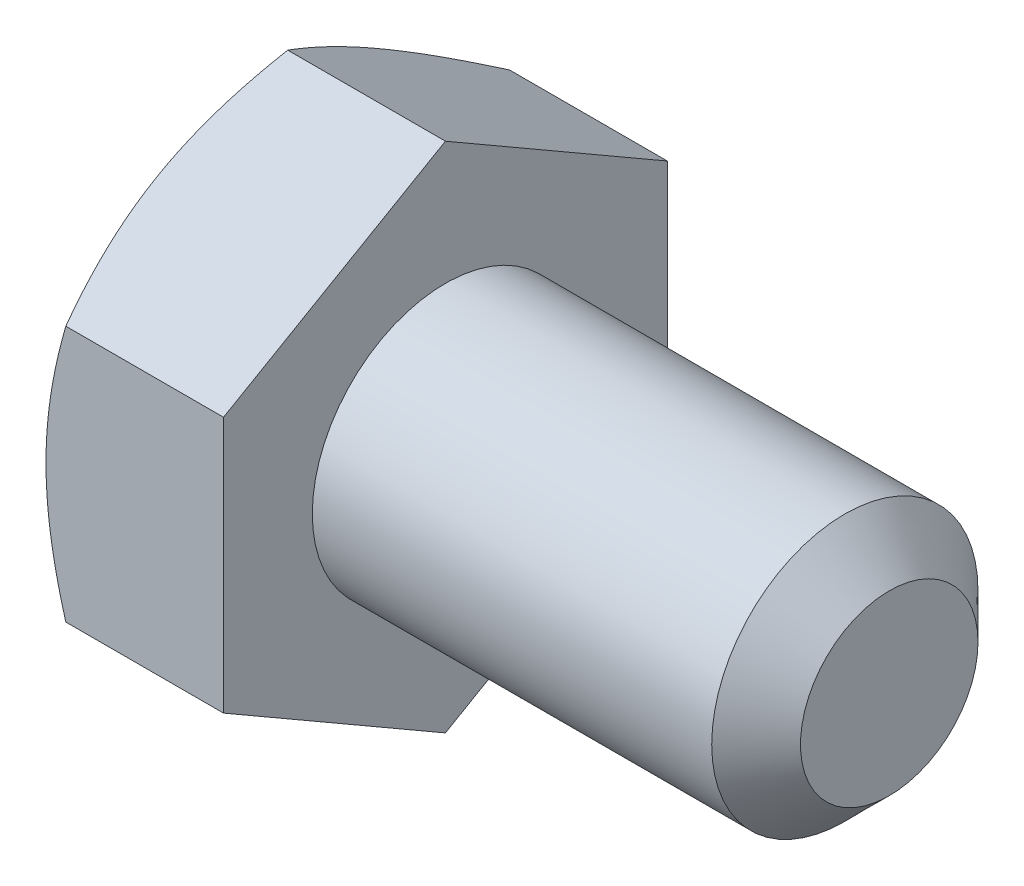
ISO-10303-21;
HEADER;
FILE_DESCRIPTION(('STEP AP214'),'2;1');
FILE_NAME('part.step','',(''),(''),'','','');
FILE_SCHEMA(('AUTOMOTIVE_DESIGN { 1 0 10303 214 1 1 1 1 }'));
ENDSEC;
DATA;
#1=APPLICATION_CONTEXT('core data for automotive mechanical design processes');
#2=APPLICATION_PROTOCOL_DEFINITION('international standard','automotive_design',2000,#1);
#3=PRODUCT_CONTEXT('',#1,'mechanical');
#4=PRODUCT('Part','Part','',(#3));
#5=PRODUCT_RELATED_PRODUCT_CATEGORY('part','',(#4));
#6=PRODUCT_DEFINITION_FORMATION('','',#4);
#7=PRODUCT_DEFINITION_CONTEXT('part definition',#1,'design');
#8=PRODUCT_DEFINITION('design','',#6,#7);
#9=PRODUCT_DEFINITION_SHAPE('','',#8);
#10=(LENGTH_UNIT() NAMED_UNIT(*) SI_UNIT(.MILLI.,.METRE.));
#11=(NAMED_UNIT(*) PLANE_ANGLE_UNIT() SI_UNIT($,.RADIAN.));
#12=(NAMED_UNIT(*) SI_UNIT($,.STERADIAN.) SOLID_ANGLE_UNIT());
#13=UNCERTAINTY_MEASURE_WITH_UNIT(LENGTH_MEASURE(1.E-05),#10,'distance_accuracy_value','');
#14=(GEOMETRIC_REPRESENTATION_CONTEXT(3) GLOBAL_UNCERTAINTY_ASSIGNED_CONTEXT((#13)) GLOBAL_UNIT_ASSIGNED_CONTEXT((#10,
#11,#12)) REPRESENTATION_CONTEXT('',''));
#15=CARTESIAN_POINT('',(0.,0.,0.));
#16=DIRECTION('',(0.,0.,1.));
#17=DIRECTION('',(1.,0.,0.));
#18=AXIS2_PLACEMENT_3D('',#15,#16,#17);
#19=CARTESIAN_POINT('',(10.0000000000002,0.,0.));
#20=DIRECTION('',(-1.,0.,0.));
#21=DIRECTION('',(0.,0.,1.));
#22=AXIS2_PLACEMENT_3D('',#19,#20,#21);
#23=CYLINDRICAL_SURFACE('',#22,3.);
#24=CARTESIAN_POINT('',(9.0000000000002,0.,0.));
#25=DIRECTION('',(1.,0.,0.));
#26=DIRECTION('',(0.,0.,-1.));
#27=AXIS2_PLACEMENT_3D('',#24,#25,#26);
#28=CIRCLE('',#27,3.);
#29=CARTESIAN_POINT('',(9.0000000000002,0.,-3.));
#30=VERTEX_POINT('',#29);
#31=EDGE_CURVE('E11',#30,#30,#28,.F.);
#32=ORIENTED_EDGE('',*,*,#31,.T.);
#33=EDGE_LOOP('',(#32));
#34=FACE_BOUND('',#33,.T.);
#35=CARTESIAN_POINT('',(0.,0.,0.));
#36=DIRECTION('',(-1.,0.,0.));
#37=DIRECTION('',(0.,0.,1.));
#38=AXIS2_PLACEMENT_3D('',#35,#36,#37);
#39=CIRCLE('',#38,3.);
#40=CARTESIAN_POINT('',(0.,0.,3.));
#41=VERTEX_POINT('',#40);
#42=EDGE_CURVE('E206',#41,#41,#39,.T.);
#43=ORIENTED_EDGE('',*,*,#42,.F.);
#44=EDGE_LOOP('',(#43));
#45=FACE_BOUND('',#44,.T.);
#46=ADVANCED_FACE('F32',(#34,#45),#23,.T.);
#47=CARTESIAN_POINT('',(10.0000000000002,0.,0.));
#48=DIRECTION('',(1.,0.,0.));
#49=DIRECTION('',(0.,0.,-1.));
#50=AXIS2_PLACEMENT_3D('',#47,#48,#49);
#51=PLANE('',#50);
#52=CARTESIAN_POINT('',(10.0000000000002,0.,0.));
#53=DIRECTION('',(1.,0.,0.));
#54=DIRECTION('',(0.,0.,-1.));
#55=AXIS2_PLACEMENT_3D('',#52,#53,#54);
#56=CIRCLE('',#55,1.99999999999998);
#57=CARTESIAN_POINT('',(10.0000000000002,0.,-1.99999999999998));
#58=VERTEX_POINT('',#57);
#59=EDGE_CURVE('E39',#58,#58,#56,.T.);
#60=ORIENTED_EDGE('',*,*,#59,.T.);
#61=EDGE_LOOP('',(#60));
#62=FACE_BOUND('',#61,.T.);
#63=ADVANCED_FACE('F192',(#62),#51,.T.);
#64=CARTESIAN_POINT('',(0.,-2.88675134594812,5.00000000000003));
#65=DIRECTION('',(-1.,0.,0.));
#66=DIRECTION('',(0.,0.,1.));
#67=AXIS2_PLACEMENT_3D('',#64,#65,#66);
#68=PLANE('',#67);
#69=DIRECTION('',(0.,0.500000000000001,0.866025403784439));
#70=VECTOR('',#69,1.);
#71=CARTESIAN_POINT('',(0.,-5.77350269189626,0.));
#72=LINE('',#71,#70);
#73=CARTESIAN_POINT('',(0.,-5.77350269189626,0.));
#74=VERTEX_POINT('',#73);
#75=CARTESIAN_POINT('',(0.,-2.88675134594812,5.00000000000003));
#76=VERTEX_POINT('',#75);
#77=EDGE_CURVE('E233',#74,#76,#72,.T.);
#78=ORIENTED_EDGE('',*,*,#77,.F.);
#79=DIRECTION('',(0.,0.500000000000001,-0.866025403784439));
#80=VECTOR('',#79,1.);
#81=CARTESIAN_POINT('',(0.,-5.77350269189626,0.));
#82=LINE('',#81,#80);
#83=CARTESIAN_POINT('',(0.,-2.88675134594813,-5.));
#84=VERTEX_POINT('',#83);
#85=EDGE_CURVE('E220',#74,#84,#82,.T.);
#86=ORIENTED_EDGE('',*,*,#85,.T.);
#87=DIRECTION('',(0.,1.,0.));
#88=VECTOR('',#87,1.);
#89=CARTESIAN_POINT('',(0.,-2.88675134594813,-5.));
#90=LINE('',#89,#88);
#91=CARTESIAN_POINT('',(0.,2.88675134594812,-5.));
#92=VERTEX_POINT('',#91);
#93=EDGE_CURVE('E223',#84,#92,#90,.T.);
#94=ORIENTED_EDGE('',*,*,#93,.T.);
#95=DIRECTION('',(0.,0.500000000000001,0.866025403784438));
#96=VECTOR('',#95,1.);
#97=CARTESIAN_POINT('',(0.,2.88675134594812,-5.));
#98=LINE('',#97,#96);
#99=CARTESIAN_POINT('',(0.,5.77350269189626,0.));
#100=VERTEX_POINT('',#99);
#101=EDGE_CURVE('E226',#92,#100,#98,.T.);
#102=ORIENTED_EDGE('',*,*,#101,.T.);
#103=DIRECTION('',(0.,0.500000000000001,-0.866025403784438));
#104=VECTOR('',#103,1.);
#105=CARTESIAN_POINT('',(0.,2.88675134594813,5.));
#106=LINE('',#105,#104);
#107=CARTESIAN_POINT('',(0.,2.88675134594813,5.));
#108=VERTEX_POINT('',#107);
#109=EDGE_CURVE('E229',#108,#100,#106,.T.);
#110=ORIENTED_EDGE('',*,*,#109,.F.);
#111=DIRECTION('',(0.,1.,0.));
#112=VECTOR('',#111,1.);
#113=CARTESIAN_POINT('',(0.,-2.88675134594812,5.00000000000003));
#114=LINE('',#113,#112);
#115=EDGE_CURVE('E231',#76,#108,#114,.T.);
#116=ORIENTED_EDGE('',*,*,#115,.F.);
#117=EDGE_LOOP('',(#78,#86,#94,#102,#110,#116));
#118=FACE_BOUND('',#117,.T.);
#119=ORIENTED_EDGE('',*,*,#42,.T.);
#120=EDGE_LOOP('',(#119));
#121=FACE_BOUND('',#120,.T.);
#122=ADVANCED_FACE('F163',(#118,#121),#68,.F.);
#123=CARTESIAN_POINT('',(-4.,-5.77350269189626,0.));
#124=DIRECTION('',(0.,0.866025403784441,-0.5));
#125=DIRECTION('',(0.,0.500000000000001,0.866025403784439));
#126=AXIS2_PLACEMENT_3D('',#123,#124,#125);
#127=PLANE('',#126);
#128=CARTESIAN_POINT('',(-3.55335134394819,-5.77361816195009,-0.000199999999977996));
#129=CARTESIAN_POINT('',(-3.62661343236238,-5.6467543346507,0.219534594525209));
#130=CARTESIAN_POINT('',(-3.69324867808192,-5.51880543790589,0.441148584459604));
#131=CARTESIAN_POINT('',(-3.8095610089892,-5.26069210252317,0.888213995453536));
#132=CARTESIAN_POINT('',(-3.85919695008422,-5.1305230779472,1.1136733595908));
#133=CARTESIAN_POINT('',(-3.93644897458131,-4.87177839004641,1.56183230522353));
#134=CARTESIAN_POINT('',(-3.96457962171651,-4.74324302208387,1.78446209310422));
#135=CARTESIAN_POINT('',(-3.98980507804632,-4.54998783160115,2.11918990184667));
#136=CARTESIAN_POINT('',(-3.99538654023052,-4.48552534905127,2.23084219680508));
#137=CARTESIAN_POINT('',(-4.00079778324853,-4.35654081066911,2.45424997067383));
#138=CARTESIAN_POINT('',(-4.0006277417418,-4.29201875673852,2.56600544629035));
#139=CARTESIAN_POINT('',(-3.99224636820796,-4.11524635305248,2.87218423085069));
#140=CARTESIAN_POINT('',(-3.97817022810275,-4.00305457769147,3.06650608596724));
#141=CARTESIAN_POINT('',(-3.93353474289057,-3.77941563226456,3.45386010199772));
#142=CARTESIAN_POINT('',(-3.90296013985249,-3.66796924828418,3.64689090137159));
#143=CARTESIAN_POINT('',(-3.82653150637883,-3.44387972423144,4.03502534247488));
#144=CARTESIAN_POINT('',(-3.78035362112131,-3.33126486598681,4.23007999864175));
#145=CARTESIAN_POINT('',(-3.67554820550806,-3.10771464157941,4.61728034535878));
#146=CARTESIAN_POINT('',(-3.61694529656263,-2.99677641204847,4.8094309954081));
#147=CARTESIAN_POINT('',(-3.55335134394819,-2.88663587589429,5.00020000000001));
#148=B_SPLINE_CURVE_WITH_KNOTS('',3,(#128,#129,#130,#131,#132,#133,#134,#135,#136,#137,#138,
#139,#140,#141,#142,#143,#144,#145,#146,#147),.UNSPECIFIED.,.F.,.F.,(4,2,2,2,2,2,2,2,2,4),(0.,
0.792555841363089,1.58701660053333,2.3618153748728,2.74884076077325,3.13585419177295,
3.80962362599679,4.48401723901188,5.17336882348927,5.86136694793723),.UNSPECIFIED.);
#149=CARTESIAN_POINT('',(-3.55341801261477,-5.77350269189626,0.));
#150=VERTEX_POINT('',#149);
#151=CARTESIAN_POINT('',(-4.,-4.33012701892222,2.5));
#152=VERTEX_POINT('',#151);
#153=EDGE_CURVE('E180',#150,#152,#148,.T.);
#154=ORIENTED_EDGE('',*,*,#153,.F.);
#155=DIRECTION('',(1.,0.,0.));
#156=VECTOR('',#155,1.);
#157=CARTESIAN_POINT('',(-4.,-5.77350269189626,0.));
#158=LINE('',#157,#156);
#159=EDGE_CURVE('E218',#150,#74,#158,.T.);
#160=ORIENTED_EDGE('',*,*,#159,.T.);
#161=ORIENTED_EDGE('',*,*,#77,.T.);
#162=DIRECTION('',(1.,0.,0.));
#163=VECTOR('',#162,1.);
#164=CARTESIAN_POINT('',(-4.,-2.88675134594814,5.));
#165=LINE('',#164,#163);
#166=CARTESIAN_POINT('',(-3.55341801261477,-2.88675134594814,5.));
#167=VERTEX_POINT('',#166);
#168=EDGE_CURVE('E209',#167,#76,#165,.T.);
#169=ORIENTED_EDGE('',*,*,#168,.F.);
#170=EDGE_CURVE('E134',#152,#167,#148,.T.);
#171=ORIENTED_EDGE('',*,*,#170,.F.);
#172=EDGE_LOOP('',(#154,#160,#161,#169,#171));
#173=FACE_BOUND('',#172,.T.);
#174=ADVANCED_FACE('F186',(#173),#127,.F.);
#175=CARTESIAN_POINT('',(-4.,-2.88675134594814,5.));
#176=DIRECTION('',(0.,0.,-1.));
#177=DIRECTION('',(-1.,0.,0.));
#178=AXIS2_PLACEMENT_3D('',#175,#176,#177);
#179=PLANE('',#178);
#180=CARTESIAN_POINT('',(-1.50175754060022,-7.87365701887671,5.));
#181=CARTESIAN_POINT('',(-1.6086809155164,-7.65421637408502,5.));
#182=CARTESIAN_POINT('',(-1.71461296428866,-7.43428458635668,5.));
#183=CARTESIAN_POINT('',(-1.92393906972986,-6.99317792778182,5.));
#184=CARTESIAN_POINT('',(-2.02733274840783,-6.77200287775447,5.));
#185=CARTESIAN_POINT('',(-2.23152152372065,-6.32706593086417,5.));
#186=CARTESIAN_POINT('',(-2.33230041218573,-6.10329657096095,5.));
#187=CARTESIAN_POINT('',(-2.52988978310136,-5.65401907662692,5.));
#188=CARTESIAN_POINT('',(-2.62670044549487,-5.42851102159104,5.));
#189=CARTESIAN_POINT('',(-2.81850105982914,-4.96773019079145,5.));
#190=CARTESIAN_POINT('',(-2.91331851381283,-4.7323852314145,5.));
#191=CARTESIAN_POINT('',(-3.09606229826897,-4.25898650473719,5.));
#192=CARTESIAN_POINT('',(-3.1839878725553,-4.02093244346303,5.));
#193=CARTESIAN_POINT('',(-3.35072723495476,-3.54214478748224,5.));
#194=CARTESIAN_POINT('',(-3.42955846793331,-3.30141732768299,5.));
#195=CARTESIAN_POINT('',(-3.57565910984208,-2.81651125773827,5.));
#196=CARTESIAN_POINT('',(-3.64293203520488,-2.57233372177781,5.));
#197=CARTESIAN_POINT('',(-3.76241038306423,-2.08173956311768,5.));
#198=CARTESIAN_POINT('',(-3.81470009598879,-1.83534384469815,5.));
#199=CARTESIAN_POINT('',(-3.90133365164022,-1.33936717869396,5.00000000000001));
#200=CARTESIAN_POINT('',(-3.93567944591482,-1.08978658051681,5.00000000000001));
#201=CARTESIAN_POINT('',(-3.98324171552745,-0.591994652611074,5.));
#202=CARTESIAN_POINT('',(-3.99673913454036,-0.34381084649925,5.));
#203=CARTESIAN_POINT('',(-4.00220795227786,0.152820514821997,5.00000000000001));
#204=CARTESIAN_POINT('',(-3.99417903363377,0.401268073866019,5.00000000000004));
#205=CARTESIAN_POINT('',(-3.96311999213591,0.819539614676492,5.00000000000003));
#206=CARTESIAN_POINT('',(-3.94552930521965,0.989794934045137,5.00000000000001));
#207=CARTESIAN_POINT('',(-3.90127081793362,1.32912938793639,5.));
#208=CARTESIAN_POINT('',(-3.87460188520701,1.49820837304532,5.));
#209=CARTESIAN_POINT('',(-3.78237229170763,2.0034117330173,5.00000000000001));
#210=CARTESIAN_POINT('',(-3.70460290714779,2.33733597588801,5.00000000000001));
#211=CARTESIAN_POINT('',(-3.56883106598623,2.83691487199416,5.00000000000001));
#212=CARTESIAN_POINT('',(-3.51971360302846,3.00513229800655,5.00000000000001));
#213=CARTESIAN_POINT('',(-3.41615110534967,3.33993504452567,5.00000000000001));
#214=CARTESIAN_POINT('',(-3.36170602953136,3.50652035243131,5.00000000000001));
#215=CARTESIAN_POINT('',(-3.24838071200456,3.83810926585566,5.00000000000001));
#216=CARTESIAN_POINT('',(-3.18950171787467,4.00311330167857,5.));
#217=CARTESIAN_POINT('',(-3.06802383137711,4.33173746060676,5.00000000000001));
#218=CARTESIAN_POINT('',(-3.00542502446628,4.49535761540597,5.00000000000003));
#219=CARTESIAN_POINT('',(-2.83201950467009,4.93598294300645,5.00000000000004));
#220=CARTESIAN_POINT('',(-2.71826266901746,5.21182602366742,5.00000000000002));
#221=CARTESIAN_POINT('',(-2.48405585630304,5.76066658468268,5.));
#222=CARTESIAN_POINT('',(-2.36360513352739,6.03366374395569,5.00000000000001));
#223=CARTESIAN_POINT('',(-2.11759609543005,6.57746623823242,5.00000000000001));
#224=CARTESIAN_POINT('',(-1.99203582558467,6.84827068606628,5.00000000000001));
#225=CARTESIAN_POINT('',(-1.73703058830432,7.38802449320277,5.00000000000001));
#226=CARTESIAN_POINT('',(-1.60758577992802,7.65697392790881,5.00000000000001));
#227=CARTESIAN_POINT('',(-1.34544789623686,8.19381940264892,5.00000000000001));
#228=CARTESIAN_POINT('',(-1.21274991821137,8.46171304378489,5.00000000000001));
#229=CARTESIAN_POINT('',(-0.944933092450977,8.99628800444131,5.00000000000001));
#230=CARTESIAN_POINT('',(-0.8098142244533,9.26296931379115,5.00000000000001));
#231=CARTESIAN_POINT('',(-0.401627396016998,10.0614145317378,5.00000000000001));
#232=CARTESIAN_POINT('',(-0.125669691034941,10.5917004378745,5.00000000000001));
#233=CARTESIAN_POINT('',(0.4018693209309,11.5934978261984,5.00000000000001));
#234=CARTESIAN_POINT('',(0.652934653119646,12.0652823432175,5.00000000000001));
#235=CARTESIAN_POINT('',(1.1580917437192,13.0072652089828,5.00000000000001));
#236=CARTESIAN_POINT('',(1.41218368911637,13.4774634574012,5.00000000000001));
#237=CARTESIAN_POINT('',(1.92174727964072,14.4150598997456,5.00000000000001));
#238=CARTESIAN_POINT('',(2.17721139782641,14.8824621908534,5.00000000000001));
#239=CARTESIAN_POINT('',(2.68985606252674,15.8162766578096,5.00000000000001));
#240=CARTESIAN_POINT('',(2.94703647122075,16.2826889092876,5.00000000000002));
#241=CARTESIAN_POINT('',(3.20484156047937,16.7487534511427,5.00000000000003));
#242=B_SPLINE_CURVE_WITH_KNOTS('',3,(#180,#181,#182,#183,#184,#185,#186,#187,#188,#189,#190,
#191,#192,#193,#194,#195,#196,#197,#198,#199,#200,#201,#202,#203,#204,#205,#206,#207,#208,#209,
#210,#211,#212,#213,#214,#215,#216,#217,#218,#219,#220,#221,#222,#223,#224,#225,#226,#227,#228,
#229,#230,#231,#232,#233,#234,#235,#236,#237,#238,#239,#240,#241),.UNSPECIFIED.,.F.,.F.,(4,2,2,
2,2,2,2,2,2,2,2,2,2,2,2,2,2,2,2,2,2,2,2,2,2,2,2,2,2,2,4),(0.,0.732320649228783,1.46474969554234,
2.20096737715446,2.93715163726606,3.69825037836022,4.45943251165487,5.2191293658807,
5.97859468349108,6.73369963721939,7.48872245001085,8.23347928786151,8.9782471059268,
9.49148539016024,10.0047877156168,11.0318914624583,11.5575684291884,12.0832494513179,
12.6087831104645,13.1343047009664,14.0293094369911,14.9244140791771,15.8198643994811,
16.7152781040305,17.6121361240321,18.5090016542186,20.3023290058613,21.9056050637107,
23.5089806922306,25.1069572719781,26.7048070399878),.UNSPECIFIED.);
#243=CARTESIAN_POINT('',(-4.,0.,5.));
#244=VERTEX_POINT('',#243);
#245=EDGE_CURVE('E235',#167,#244,#242,.T.);
#246=ORIENTED_EDGE('',*,*,#245,.F.);
#247=ORIENTED_EDGE('',*,*,#168,.T.);
#248=ORIENTED_EDGE('',*,*,#115,.T.);
#249=DIRECTION('',(1.,0.,0.));
#250=VECTOR('',#249,1.);
#251=CARTESIAN_POINT('',(-4.,2.88675134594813,5.));
#252=LINE('',#251,#250);
#253=CARTESIAN_POINT('',(-3.55341801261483,2.88675134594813,5.));
#254=VERTEX_POINT('',#253);
#255=EDGE_CURVE('E211',#254,#108,#252,.T.);
#256=ORIENTED_EDGE('',*,*,#255,.F.);
#257=EDGE_CURVE('E105',#244,#254,#242,.T.);
#258=ORIENTED_EDGE('',*,*,#257,.F.);
#259=EDGE_LOOP('',(#246,#247,#248,#256,#258));
#260=FACE_BOUND('',#259,.T.);
#261=ADVANCED_FACE('F189',(#260),#179,.F.);
#262=CARTESIAN_POINT('',(-4.,2.88675134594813,5.));
#263=DIRECTION('',(0.,-0.86602540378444,-0.5));
#264=DIRECTION('',(0.,0.500000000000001,-0.866025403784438));
#265=AXIS2_PLACEMENT_3D('',#262,#263,#264);
#266=PLANE('',#265);
#267=CARTESIAN_POINT('',(-3.55335134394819,2.88663587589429,5.00020000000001));
#268=CARTESIAN_POINT('',(-3.62661343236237,3.01349970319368,4.78046540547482));
#269=CARTESIAN_POINT('',(-3.69324867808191,3.14144859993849,4.55885141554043));
#270=CARTESIAN_POINT('',(-3.80956100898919,3.39956193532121,4.11178600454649));
#271=CARTESIAN_POINT('',(-3.85919695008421,3.52973095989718,3.88632664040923));
#272=CARTESIAN_POINT('',(-3.9364489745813,3.78847564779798,3.43816769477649));
#273=CARTESIAN_POINT('',(-3.96457962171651,3.91701101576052,3.21553790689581));
#274=CARTESIAN_POINT('',(-3.98980507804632,4.11026620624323,2.88081009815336));
#275=CARTESIAN_POINT('',(-3.99538654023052,4.17472868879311,2.76915780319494));
#276=CARTESIAN_POINT('',(-4.00079778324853,4.30371322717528,2.5457500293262));
#277=CARTESIAN_POINT('',(-4.0006277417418,4.36823528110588,2.43399455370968));
#278=CARTESIAN_POINT('',(-3.99224636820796,4.54500768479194,2.12781576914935));
#279=CARTESIAN_POINT('',(-3.97817022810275,4.65719946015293,1.93349391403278));
#280=CARTESIAN_POINT('',(-3.93353474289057,4.88083840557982,1.54613989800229));
#281=CARTESIAN_POINT('',(-3.90296013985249,4.99228478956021,1.35310909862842));
#282=CARTESIAN_POINT('',(-3.82653150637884,5.21637431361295,0.964974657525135));
#283=CARTESIAN_POINT('',(-3.78035362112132,5.32898917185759,0.769920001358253));
#284=CARTESIAN_POINT('',(-3.67554820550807,5.55253939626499,0.382719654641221));
#285=CARTESIAN_POINT('',(-3.61694529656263,5.66347762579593,0.190569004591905));
#286=CARTESIAN_POINT('',(-3.55335134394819,5.77361816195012,-0.000200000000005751));
#287=B_SPLINE_CURVE_WITH_KNOTS('',3,(#267,#268,#269,#270,#271,#272,#273,#274,#275,#276,#277,
#278,#279,#280,#281,#282,#283,#284,#285,#286),.UNSPECIFIED.,.F.,.F.,(4,2,2,2,2,2,2,2,2,4),(0.,
0.792555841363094,1.58701660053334,2.36181537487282,2.74884076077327,3.13585419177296,
3.80962362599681,4.48401723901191,5.17336882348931,5.86136694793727),.UNSPECIFIED.);
#288=CARTESIAN_POINT('',(-4.,4.3301270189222,2.50000000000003));
#289=VERTEX_POINT('',#288);
#290=EDGE_CURVE('E101',#254,#289,#287,.T.);
#291=ORIENTED_EDGE('',*,*,#290,.F.);
#292=ORIENTED_EDGE('',*,*,#255,.T.);
#293=ORIENTED_EDGE('',*,*,#109,.T.);
#294=DIRECTION('',(1.,0.,0.));
#295=VECTOR('',#294,1.);
#296=CARTESIAN_POINT('',(-4.,5.77350269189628,0.));
#297=LINE('',#296,#295);
#298=CARTESIAN_POINT('',(-3.55341801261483,5.77350269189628,0.));
#299=VERTEX_POINT('',#298);
#300=EDGE_CURVE('E133',#299,#100,#297,.T.);
#301=ORIENTED_EDGE('',*,*,#300,.F.);
#302=EDGE_CURVE('E109',#289,#299,#287,.T.);
#303=ORIENTED_EDGE('',*,*,#302,.F.);
#304=EDGE_LOOP('',(#291,#292,#293,#301,#303));
#305=FACE_BOUND('',#304,.T.);
#306=ADVANCED_FACE('F131',(#305),#266,.F.);
#307=CARTESIAN_POINT('',(-4.,2.88675134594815,-5.00000000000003));
#308=DIRECTION('',(0.,0.86602540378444,-0.5));
#309=DIRECTION('',(0.,0.500000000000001,0.866025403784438));
#310=AXIS2_PLACEMENT_3D('',#307,#308,#309);
#311=PLANE('',#310);
#312=DIRECTION('',(1.,0.,0.));
#313=VECTOR('',#312,1.);
#314=CARTESIAN_POINT('',(-4.,2.88675134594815,-5.00000000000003));
#315=LINE('',#314,#313);
#316=CARTESIAN_POINT('',(-3.55341801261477,2.88675134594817,-5.00000000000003));
#317=VERTEX_POINT('',#316);
#318=EDGE_CURVE('E214',#317,#92,#315,.T.);
#319=ORIENTED_EDGE('',*,*,#318,.F.);
#320=CARTESIAN_POINT('',(-3.55335134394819,2.88663587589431,-5.00019999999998));
#321=CARTESIAN_POINT('',(-3.62661343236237,3.01349970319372,-4.7804654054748));
#322=CARTESIAN_POINT('',(-3.6932486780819,3.14144859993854,-4.55885141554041));
#323=CARTESIAN_POINT('',(-3.80956100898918,3.39956193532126,-4.11178600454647));
#324=CARTESIAN_POINT('',(-3.8591969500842,3.52973095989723,-3.8863266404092));
#325=CARTESIAN_POINT('',(-3.93644897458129,3.78847564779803,-3.43816769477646));
#326=CARTESIAN_POINT('',(-3.9645796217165,3.91701101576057,-3.21553790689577));
#327=CARTESIAN_POINT('',(-3.9898050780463,4.11026620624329,-2.88081009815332));
#328=CARTESIAN_POINT('',(-3.9953865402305,4.17472868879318,-2.76915780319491));
#329=CARTESIAN_POINT('',(-4.00079778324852,4.30371322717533,-2.54575002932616));
#330=CARTESIAN_POINT('',(-4.00062774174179,4.36823528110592,-2.43399455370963));
#331=CARTESIAN_POINT('',(-3.99224636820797,4.54500768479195,-2.12781576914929));
#332=CARTESIAN_POINT('',(-3.97817022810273,4.65719946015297,-1.93349391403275));
#333=CARTESIAN_POINT('',(-3.93353474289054,4.88083840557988,-1.54613989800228));
#334=CARTESIAN_POINT('',(-3.90296013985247,4.99228478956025,-1.35310909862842));
#335=CARTESIAN_POINT('',(-3.82653150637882,5.21637431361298,-0.96497465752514));
#336=CARTESIAN_POINT('',(-3.7803536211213,5.32898917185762,-0.769920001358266));
#337=CARTESIAN_POINT('',(-3.67554820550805,5.55253939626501,-0.382719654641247));
#338=CARTESIAN_POINT('',(-3.61694529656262,5.66347762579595,-0.190569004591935));
#339=CARTESIAN_POINT('',(-3.55335134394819,5.77361816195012,0.000199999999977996));
#340=B_SPLINE_CURVE_WITH_KNOTS('',3,(#320,#321,#322,#323,#324,#325,#326,#327,#328,#329,#330,
#331,#332,#333,#334,#335,#336,#337,#338,#339),.UNSPECIFIED.,.F.,.F.,(4,2,2,2,2,2,2,2,2,4),(0.,
0.792555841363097,1.58701660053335,2.36181537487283,2.74884076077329,3.13585419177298,
3.80962362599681,4.48401723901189,5.17336882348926,5.86136694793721),.UNSPECIFIED.);
#341=CARTESIAN_POINT('',(-4.,4.33012701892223,-2.5));
#342=VERTEX_POINT('',#341);
#343=EDGE_CURVE('E136',#317,#342,#340,.T.);
#344=ORIENTED_EDGE('',*,*,#343,.T.);
#345=EDGE_CURVE('E116',#342,#299,#340,.T.);
#346=ORIENTED_EDGE('',*,*,#345,.T.);
#347=ORIENTED_EDGE('',*,*,#300,.T.);
#348=ORIENTED_EDGE('',*,*,#101,.F.);
#349=EDGE_LOOP('',(#319,#344,#346,#347,#348));
#350=FACE_BOUND('',#349,.T.);
#351=ADVANCED_FACE('F261',(#350),#311,.T.);
#352=CARTESIAN_POINT('',(-4.,-2.88675134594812,-5.));
#353=DIRECTION('',(0.,0.,-1.));
#354=DIRECTION('',(-1.,0.,0.));
#355=AXIS2_PLACEMENT_3D('',#352,#353,#354);
#356=PLANE('',#355);
#357=DIRECTION('',(1.,0.,0.));
#358=VECTOR('',#357,1.);
#359=CARTESIAN_POINT('',(-4.,-2.88675134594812,-5.));
#360=LINE('',#359,#358);
#361=CARTESIAN_POINT('',(-3.55341801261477,-2.88675134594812,-5.));
#362=VERTEX_POINT('',#361);
#363=EDGE_CURVE('E216',#362,#84,#360,.T.);
#364=ORIENTED_EDGE('',*,*,#363,.F.);
#365=CARTESIAN_POINT('',(-1.50175754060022,-7.87365701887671,-5.));
#366=CARTESIAN_POINT('',(-1.6086809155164,-7.65421637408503,-5.00000000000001));
#367=CARTESIAN_POINT('',(-1.71461296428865,-7.43428458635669,-5.00000000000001));
#368=CARTESIAN_POINT('',(-1.92393906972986,-6.99317792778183,-5.00000000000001));
#369=CARTESIAN_POINT('',(-2.02733274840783,-6.77200287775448,-5.00000000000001));
#370=CARTESIAN_POINT('',(-2.23152152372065,-6.32706593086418,-5.00000000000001));
#371=CARTESIAN_POINT('',(-2.33230041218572,-6.10329657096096,-5.00000000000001));
#372=CARTESIAN_POINT('',(-2.52988978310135,-5.65401907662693,-5.00000000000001));
#373=CARTESIAN_POINT('',(-2.62670044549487,-5.42851102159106,-5.00000000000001));
#374=CARTESIAN_POINT('',(-2.81850105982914,-4.96773019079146,-5.00000000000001));
#375=CARTESIAN_POINT('',(-2.91331851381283,-4.73238523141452,-5.00000000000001));
#376=CARTESIAN_POINT('',(-3.09606229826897,-4.2589865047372,-5.));
#377=CARTESIAN_POINT('',(-3.18398787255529,-4.02093244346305,-5.));
#378=CARTESIAN_POINT('',(-3.35072723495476,-3.54214478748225,-5.00000000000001));
#379=CARTESIAN_POINT('',(-3.42955846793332,-3.30141732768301,-5.00000000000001));
#380=CARTESIAN_POINT('',(-3.57565910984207,-2.81651125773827,-5.));
#381=CARTESIAN_POINT('',(-3.64293203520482,-2.5723337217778,-4.99999999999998));
#382=CARTESIAN_POINT('',(-3.76241038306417,-2.08173956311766,-4.99999999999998));
#383=CARTESIAN_POINT('',(-3.81470009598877,-1.83534384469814,-5.));
#384=CARTESIAN_POINT('',(-3.90133365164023,-1.33936717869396,-5.00000000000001));
#385=CARTESIAN_POINT('',(-3.93567944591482,-1.08978658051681,-5.00000000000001));
#386=CARTESIAN_POINT('',(-3.98324171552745,-0.591994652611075,-5.));
#387=CARTESIAN_POINT('',(-3.99673913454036,-0.343810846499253,-5.));
#388=CARTESIAN_POINT('',(-4.00220795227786,0.152820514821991,-5.));
#389=CARTESIAN_POINT('',(-3.99417903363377,0.401268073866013,-5.00000000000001));
#390=CARTESIAN_POINT('',(-3.96311999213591,0.819539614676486,-5.));
#391=CARTESIAN_POINT('',(-3.94552930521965,0.989794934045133,-5.));
#392=CARTESIAN_POINT('',(-3.90127081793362,1.32912938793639,-5.));
#393=CARTESIAN_POINT('',(-3.87460188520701,1.49820837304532,-5.));
#394=CARTESIAN_POINT('',(-3.78237229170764,2.0034117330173,-5.));
#395=CARTESIAN_POINT('',(-3.7046029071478,2.33733597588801,-5.));
#396=CARTESIAN_POINT('',(-3.56883106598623,2.83691487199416,-5.));
#397=CARTESIAN_POINT('',(-3.51971360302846,3.00513229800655,-5.));
#398=CARTESIAN_POINT('',(-3.41615110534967,3.33993504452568,-5.));
#399=CARTESIAN_POINT('',(-3.36170602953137,3.50652035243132,-5.));
#400=CARTESIAN_POINT('',(-3.24838071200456,3.83810926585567,-5.));
#401=CARTESIAN_POINT('',(-3.18950171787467,4.00311330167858,-5.00000000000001));
#402=CARTESIAN_POINT('',(-3.06802383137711,4.33173746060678,-5.));
#403=CARTESIAN_POINT('',(-3.00542502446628,4.49535761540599,-4.99999999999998));
#404=CARTESIAN_POINT('',(-2.83201950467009,4.93598294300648,-4.99999999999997));
#405=CARTESIAN_POINT('',(-2.71826266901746,5.21182602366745,-4.99999999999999));
#406=CARTESIAN_POINT('',(-2.48405585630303,5.7606665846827,-5.00000000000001));
#407=CARTESIAN_POINT('',(-2.36360513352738,6.03366374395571,-5.));
#408=CARTESIAN_POINT('',(-2.11759609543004,6.57746623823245,-5.));
#409=CARTESIAN_POINT('',(-1.99203582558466,6.8482706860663,-5.));
#410=CARTESIAN_POINT('',(-1.73703058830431,7.38802449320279,-5.));
#411=CARTESIAN_POINT('',(-1.607585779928,7.65697392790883,-5.));
#412=CARTESIAN_POINT('',(-1.34544789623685,8.19381940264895,-5.));
#413=CARTESIAN_POINT('',(-1.21274991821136,8.46171304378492,-5.));
#414=CARTESIAN_POINT('',(-0.944933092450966,8.99628800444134,-5.));
#415=CARTESIAN_POINT('',(-0.809814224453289,9.26296931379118,-5.));
#416=CARTESIAN_POINT('',(-0.401627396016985,10.0614145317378,-5.));
#417=CARTESIAN_POINT('',(-0.125669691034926,10.5917004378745,-5.));
#418=CARTESIAN_POINT('',(0.401869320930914,11.5934978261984,-5.));
#419=CARTESIAN_POINT('',(0.652934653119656,12.0652823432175,-5.));
#420=CARTESIAN_POINT('',(1.15809174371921,13.0072652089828,-5.));
#421=CARTESIAN_POINT('',(1.41218368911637,13.4774634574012,-5.));
#422=CARTESIAN_POINT('',(1.92174727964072,14.4150598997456,-5.));
#423=CARTESIAN_POINT('',(2.1772113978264,14.8824621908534,-5.));
#424=CARTESIAN_POINT('',(2.68985606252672,15.8162766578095,-4.99999999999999));
#425=CARTESIAN_POINT('',(2.94703647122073,16.2826889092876,-4.99999999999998));
#426=CARTESIAN_POINT('',(3.20484156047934,16.7487534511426,-4.99999999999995));
#427=B_SPLINE_CURVE_WITH_KNOTS('',3,(#365,#366,#367,#368,#369,#370,#371,#372,#373,#374,#375,
#376,#377,#378,#379,#380,#381,#382,#383,#384,#385,#386,#387,#388,#389,#390,#391,#392,#393,#394,
#395,#396,#397,#398,#399,#400,#401,#402,#403,#404,#405,#406,#407,#408,#409,#410,#411,#412,#413,
#414,#415,#416,#417,#418,#419,#420,#421,#422,#423,#424,#425,#426),.UNSPECIFIED.,.F.,.F.,(4,2,2,
2,2,2,2,2,2,2,2,2,2,2,2,2,2,2,2,2,2,2,2,2,2,2,2,2,2,2,4),(0.,0.732320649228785,1.46474969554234,
2.20096737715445,2.93715163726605,3.69825037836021,4.45943251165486,5.2191293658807,
5.97859468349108,6.73369963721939,7.48872245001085,8.23347928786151,8.97824710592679,
9.49148539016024,10.0047877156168,11.0318914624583,11.5575684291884,12.0832494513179,
12.6087831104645,13.1343047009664,14.0293094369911,14.9244140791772,15.8198643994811,
16.7152781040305,17.6121361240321,18.5090016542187,20.3023290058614,21.9056050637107,
23.5089806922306,25.1069572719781,26.7048070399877),.UNSPECIFIED.);
#428=CARTESIAN_POINT('',(-4.,0.,-5.));
#429=VERTEX_POINT('',#428);
#430=EDGE_CURVE('E54',#362,#429,#427,.T.);
#431=ORIENTED_EDGE('',*,*,#430,.T.);
#432=EDGE_CURVE('E185',#429,#317,#427,.T.);
#433=ORIENTED_EDGE('',*,*,#432,.T.);
#434=ORIENTED_EDGE('',*,*,#318,.T.);
#435=ORIENTED_EDGE('',*,*,#93,.F.);
#436=EDGE_LOOP('',(#364,#431,#433,#434,#435));
#437=FACE_BOUND('',#436,.T.);
#438=ADVANCED_FACE('F257',(#437),#356,.T.);
#439=CARTESIAN_POINT('',(-4.,-5.77350269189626,0.));
#440=DIRECTION('',(0.,-0.86602540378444,-0.5));
#441=DIRECTION('',(0.,0.500000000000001,-0.866025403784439));
#442=AXIS2_PLACEMENT_3D('',#439,#440,#441);
#443=PLANE('',#442);
#444=ORIENTED_EDGE('',*,*,#159,.F.);
#445=CARTESIAN_POINT('',(-3.55335134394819,-5.77361816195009,0.000200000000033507));
#446=CARTESIAN_POINT('',(-3.62661343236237,-5.64675433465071,-0.219534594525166));
#447=CARTESIAN_POINT('',(-3.69324867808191,-5.5188054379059,-0.44114858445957));
#448=CARTESIAN_POINT('',(-3.80956100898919,-5.26069210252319,-0.888213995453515));
#449=CARTESIAN_POINT('',(-3.85919695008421,-5.13052307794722,-1.11367335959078));
#450=CARTESIAN_POINT('',(-3.9364489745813,-4.87177839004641,-1.56183230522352));
#451=CARTESIAN_POINT('',(-3.96457962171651,-4.74324302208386,-1.7844620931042));
#452=CARTESIAN_POINT('',(-3.98980507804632,-4.54998783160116,-2.11918990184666));
#453=CARTESIAN_POINT('',(-3.99538654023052,-4.48552534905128,-2.23084219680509));
#454=CARTESIAN_POINT('',(-4.00079778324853,-4.3565408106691,-2.45424997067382));
#455=CARTESIAN_POINT('',(-4.0006277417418,-4.29201875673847,-2.56600544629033));
#456=CARTESIAN_POINT('',(-3.99224636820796,-4.1152463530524,-2.87218423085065));
#457=CARTESIAN_POINT('',(-3.97817022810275,-4.00305457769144,-3.06650608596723));
#458=CARTESIAN_POINT('',(-3.93353474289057,-3.77941563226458,-3.45386010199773));
#459=CARTESIAN_POINT('',(-3.90296013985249,-3.66796924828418,-3.64689090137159));
#460=CARTESIAN_POINT('',(-3.82653150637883,-3.44387972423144,-4.03502534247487));
#461=CARTESIAN_POINT('',(-3.78035362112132,-3.3312648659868,-4.23007999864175));
#462=CARTESIAN_POINT('',(-3.67554820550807,-3.10771464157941,-4.61728034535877));
#463=CARTESIAN_POINT('',(-3.61694529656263,-2.99677641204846,-4.80943099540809));
#464=CARTESIAN_POINT('',(-3.55335134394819,-2.88663587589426,-5.00019999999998));
#465=B_SPLINE_CURVE_WITH_KNOTS('',3,(#445,#446,#447,#448,#449,#450,#451,#452,#453,#454,#455,
#456,#457,#458,#459,#460,#461,#462,#463,#464),.UNSPECIFIED.,.F.,.F.,(4,2,2,2,2,2,2,2,2,4),(0.,
0.792555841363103,1.58701660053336,2.36181537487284,2.7488407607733,3.135854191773,
3.80962362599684,4.48401723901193,5.17336882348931,5.86136694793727),.UNSPECIFIED.);
#466=CARTESIAN_POINT('',(-4.,-4.33012701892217,-2.5));
#467=VERTEX_POINT('',#466);
#468=EDGE_CURVE('E249',#150,#467,#465,.T.);
#469=ORIENTED_EDGE('',*,*,#468,.T.);
#470=EDGE_CURVE('E128',#467,#362,#465,.T.);
#471=ORIENTED_EDGE('',*,*,#470,.T.);
#472=ORIENTED_EDGE('',*,*,#363,.T.);
#473=ORIENTED_EDGE('',*,*,#85,.F.);
#474=EDGE_LOOP('',(#444,#469,#471,#472,#473));
#475=FACE_BOUND('',#474,.T.);
#476=ADVANCED_FACE('F253',(#475),#443,.T.);
#477=CARTESIAN_POINT('',(-4.,0.,0.));
#478=DIRECTION('',(1.,0.,0.));
#479=DIRECTION('',(0.,0.,1.));
#480=AXIS2_PLACEMENT_3D('',#477,#478,#479);
#481=CONICAL_SURFACE('',#480,5.,1.0471975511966);
#482=ORIENTED_EDGE('',*,*,#170,.T.);
#483=ORIENTED_EDGE('',*,*,#245,.T.);
#484=CARTESIAN_POINT('',(-4.,0.,0.));
#485=DIRECTION('',(-1.,0.,0.));
#486=DIRECTION('',(0.,0.,1.));
#487=AXIS2_PLACEMENT_3D('',#484,#485,#486);
#488=CIRCLE('',#487,5.);
#489=EDGE_CURVE('E123',#152,#244,#488,.T.);
#490=ORIENTED_EDGE('',*,*,#489,.F.);
#491=EDGE_LOOP('',(#482,#483,#490));
#492=FACE_BOUND('',#491,.T.);
#493=ADVANCED_FACE('F161',(#492),#481,.T.);
#494=ORIENTED_EDGE('',*,*,#468,.F.);
#495=ORIENTED_EDGE('',*,*,#153,.T.);
#496=EDGE_CURVE('E205',#467,#152,#488,.T.);
#497=ORIENTED_EDGE('',*,*,#496,.F.);
#498=EDGE_LOOP('',(#494,#495,#497));
#499=FACE_BOUND('',#498,.T.);
#500=ADVANCED_FACE('F160',(#499),#481,.T.);
#501=ORIENTED_EDGE('',*,*,#430,.F.);
#502=ORIENTED_EDGE('',*,*,#470,.F.);
#503=EDGE_CURVE('E292',#429,#467,#488,.T.);
#504=ORIENTED_EDGE('',*,*,#503,.F.);
#505=EDGE_LOOP('',(#501,#502,#504));
#506=FACE_BOUND('',#505,.T.);
#507=ADVANCED_FACE('F154',(#506),#481,.T.);
#508=ORIENTED_EDGE('',*,*,#343,.F.);
#509=ORIENTED_EDGE('',*,*,#432,.F.);
#510=EDGE_CURVE('E121',#342,#429,#488,.T.);
#511=ORIENTED_EDGE('',*,*,#510,.F.);
#512=EDGE_LOOP('',(#508,#509,#511));
#513=FACE_BOUND('',#512,.T.);
#514=ADVANCED_FACE('F159',(#513),#481,.T.);
#515=EDGE_CURVE('E113',#289,#342,#488,.T.);
#516=ORIENTED_EDGE('',*,*,#515,.F.);
#517=ORIENTED_EDGE('',*,*,#302,.T.);
#518=ORIENTED_EDGE('',*,*,#345,.F.);
#519=EDGE_LOOP('',(#516,#517,#518));
#520=FACE_BOUND('',#519,.T.);
#521=ADVANCED_FACE('F114',(#520),#481,.T.);
#522=CARTESIAN_POINT('',(-4.,0.,0.));
#523=DIRECTION('',(-1.,0.,0.));
#524=DIRECTION('',(0.,0.,1.));
#525=AXIS2_PLACEMENT_3D('',#522,#523,#524);
#526=CIRCLE('',#525,5.);
#527=EDGE_CURVE('E46',#244,#289,#526,.T.);
#528=ORIENTED_EDGE('',*,*,#527,.F.);
#529=ORIENTED_EDGE('',*,*,#257,.T.);
#530=ORIENTED_EDGE('',*,*,#290,.T.);
#531=EDGE_LOOP('',(#528,#529,#530));
#532=FACE_BOUND('',#531,.T.);
#533=ADVANCED_FACE('F103',(#532),#481,.T.);
#534=CARTESIAN_POINT('',(-4.,-2.88675134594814,5.));
#535=DIRECTION('',(-1.,0.,0.));
#536=DIRECTION('',(0.,0.,1.));
#537=AXIS2_PLACEMENT_3D('',#534,#535,#536);
#538=PLANE('',#537);
#539=ORIENTED_EDGE('',*,*,#489,.T.);
#540=ORIENTED_EDGE('',*,*,#527,.T.);
#541=ORIENTED_EDGE('',*,*,#515,.T.);
#542=ORIENTED_EDGE('',*,*,#510,.T.);
#543=ORIENTED_EDGE('',*,*,#503,.T.);
#544=ORIENTED_EDGE('',*,*,#496,.T.);
#545=EDGE_LOOP('',(#539,#540,#541,#542,#543,#544));
#546=FACE_BOUND('',#545,.T.);
#547=ADVANCED_FACE('F125',(#546),#538,.T.);
#548=CARTESIAN_POINT('',(10.0000000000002,0.,0.));
#549=DIRECTION('',(-1.,0.,0.));
#550=DIRECTION('',(0.,0.,1.));
#551=AXIS2_PLACEMENT_3D('',#548,#549,#550);
#552=CONICAL_SURFACE('',#551,1.99999999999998,0.785398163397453);
#553=ORIENTED_EDGE('',*,*,#31,.F.);
#554=EDGE_LOOP('',(#553));
#555=FACE_BOUND('',#554,.T.);
#556=ORIENTED_EDGE('',*,*,#59,.F.);
#557=EDGE_LOOP('',(#556));
#558=FACE_BOUND('',#557,.T.);
#559=ADVANCED_FACE('F162',(#555,#558),#552,.T.);
#560=CLOSED_SHELL('',(#46,#63,#122,#174,#261,#306,#351,#438,#476,#493,#500,#507,#514,#521,#533,
#547,#559));
#561=MANIFOLD_SOLID_BREP('B2',#560);
#562=ADVANCED_BREP_SHAPE_REPRESENTATION('',(#18,#561),#14);
#563=SHAPE_DEFINITION_REPRESENTATION(#9,#562);
ENDSEC;
END-ISO-10303-21;
